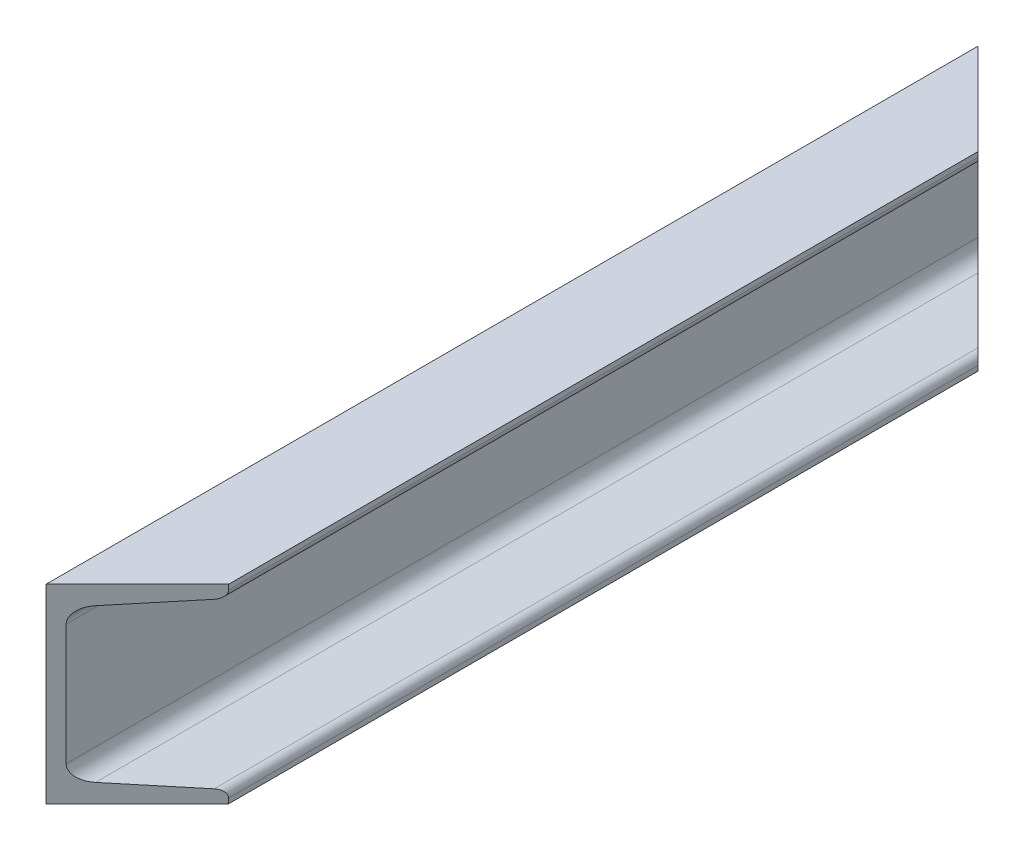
ISO-10303-21;
HEADER;
FILE_DESCRIPTION(('STEP AP214'),'2;1');
FILE_NAME('part.step','',(''),(''),'','','');
FILE_SCHEMA(('AUTOMOTIVE_DESIGN { 1 0 10303 214 1 1 1 1 }'));
ENDSEC;
DATA;
#1=APPLICATION_CONTEXT('core data for automotive mechanical design processes');
#2=APPLICATION_PROTOCOL_DEFINITION('international standard','automotive_design',2000,#1);
#3=PRODUCT_CONTEXT('',#1,'mechanical');
#4=PRODUCT('Part','Part','',(#3));
#5=PRODUCT_RELATED_PRODUCT_CATEGORY('part','',(#4));
#6=PRODUCT_DEFINITION_FORMATION('','',#4);
#7=PRODUCT_DEFINITION_CONTEXT('part definition',#1,'design');
#8=PRODUCT_DEFINITION('design','',#6,#7);
#9=PRODUCT_DEFINITION_SHAPE('','',#8);
#10=(LENGTH_UNIT() NAMED_UNIT(*) SI_UNIT(.MILLI.,.METRE.));
#11=(NAMED_UNIT(*) PLANE_ANGLE_UNIT() SI_UNIT($,.RADIAN.));
#12=(NAMED_UNIT(*) SI_UNIT($,.STERADIAN.) SOLID_ANGLE_UNIT());
#13=UNCERTAINTY_MEASURE_WITH_UNIT(LENGTH_MEASURE(1.E-05),#10,'distance_accuracy_value','');
#14=(GEOMETRIC_REPRESENTATION_CONTEXT(3) GLOBAL_UNCERTAINTY_ASSIGNED_CONTEXT((#13)) GLOBAL_UNIT_ASSIGNED_CONTEXT((#10,
#11,#12)) REPRESENTATION_CONTEXT('',''));
#15=CARTESIAN_POINT('',(0.,0.,0.));
#16=DIRECTION('',(0.,0.,1.));
#17=DIRECTION('',(1.,0.,0.));
#18=AXIS2_PLACEMENT_3D('',#15,#16,#17);
#19=CARTESIAN_POINT('',(48.,47.3249453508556,490.));
#20=DIRECTION('',(-1.,0.,0.));
#21=DIRECTION('',(0.,0.,1.));
#22=AXIS2_PLACEMENT_3D('',#19,#20,#21);
#23=PLANE('',#22);
#24=DIRECTION('',(0.,0.,-1.));
#25=VECTOR('',#24,1.);
#26=CARTESIAN_POINT('',(48.,47.3249453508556,490.));
#27=LINE('',#26,#25);
#28=CARTESIAN_POINT('',(48.,47.3249453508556,441.999999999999));
#29=VERTEX_POINT('',#28);
#30=CARTESIAN_POINT('',(48.,47.3249453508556,48.0000000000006));
#31=VERTEX_POINT('',#30);
#32=EDGE_CURVE('E172',#29,#31,#27,.T.);
#33=ORIENTED_EDGE('',*,*,#32,.T.);
#34=DIRECTION('',(0.,1.,0.));
#35=VECTOR('',#34,1.);
#36=CARTESIAN_POINT('',(48.0000000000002,-440.,48.0000000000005));
#37=LINE('',#36,#35);
#38=CARTESIAN_POINT('',(48.0000000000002,50.,48.0000000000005));
#39=VERTEX_POINT('',#38);
#40=EDGE_CURVE('E142',#31,#39,#37,.T.);
#41=ORIENTED_EDGE('',*,*,#40,.T.);
#42=DIRECTION('',(0.,0.,-1.));
#43=VECTOR('',#42,1.);
#44=CARTESIAN_POINT('',(48.,50.,490.));
#45=LINE('',#44,#43);
#46=CARTESIAN_POINT('',(48.,50.,441.999999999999));
#47=VERTEX_POINT('',#46);
#48=EDGE_CURVE('E11',#47,#39,#45,.T.);
#49=ORIENTED_EDGE('',*,*,#48,.F.);
#50=DIRECTION('',(0.,1.,0.));
#51=VECTOR('',#50,1.);
#52=CARTESIAN_POINT('',(48.,-440.,441.999999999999));
#53=LINE('',#52,#51);
#54=EDGE_CURVE('E200',#29,#47,#53,.T.);
#55=ORIENTED_EDGE('',*,*,#54,.F.);
#56=EDGE_LOOP('',(#33,#41,#49,#55));
#57=FACE_BOUND('',#56,.T.);
#58=ADVANCED_FACE('F41',(#57),#23,.F.);
#59=CARTESIAN_POINT('',(48.,50.,490.));
#60=DIRECTION('',(0.,-1.,0.));
#61=DIRECTION('',(1.,0.,0.));
#62=AXIS2_PLACEMENT_3D('',#59,#60,#61);
#63=PLANE('',#62);
#64=ORIENTED_EDGE('',*,*,#48,.T.);
#65=DIRECTION('',(0.707106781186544,0.,0.707106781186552));
#66=VECTOR('',#65,1.);
#67=CARTESIAN_POINT('',(48.0000000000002,50.,48.0000000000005));
#68=LINE('',#67,#66);
#69=CARTESIAN_POINT('',(0.,50.,0.));
#70=VERTEX_POINT('',#69);
#71=EDGE_CURVE('E129',#70,#39,#68,.T.);
#72=ORIENTED_EDGE('',*,*,#71,.F.);
#73=DIRECTION('',(0.,0.,-1.));
#74=VECTOR('',#73,1.);
#75=CARTESIAN_POINT('',(0.,50.,490.));
#76=LINE('',#75,#74);
#77=CARTESIAN_POINT('',(0.,50.,490.));
#78=VERTEX_POINT('',#77);
#79=EDGE_CURVE('E48',#78,#70,#76,.T.);
#80=ORIENTED_EDGE('',*,*,#79,.F.);
#81=DIRECTION('',(-0.707106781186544,0.,0.707106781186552));
#82=VECTOR('',#81,1.);
#83=CARTESIAN_POINT('',(48.,50.,441.999999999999));
#84=LINE('',#83,#82);
#85=EDGE_CURVE('E55',#47,#78,#84,.T.);
#86=ORIENTED_EDGE('',*,*,#85,.F.);
#87=EDGE_LOOP('',(#64,#72,#80,#86));
#88=FACE_BOUND('',#87,.T.);
#89=ADVANCED_FACE('F139',(#88),#63,.F.);
#90=CARTESIAN_POINT('',(0.,50.,490.));
#91=DIRECTION('',(1.,0.,0.));
#92=DIRECTION('',(0.,1.,0.));
#93=AXIS2_PLACEMENT_3D('',#90,#91,#92);
#94=PLANE('',#93);
#95=DIRECTION('',(0.,-1.,0.));
#96=VECTOR('',#95,1.);
#97=CARTESIAN_POINT('',(0.,50.,0.));
#98=LINE('',#97,#96);
#99=CARTESIAN_POINT('',(0.,-50.,0.));
#100=VERTEX_POINT('',#99);
#101=EDGE_CURVE('E126',#70,#100,#98,.T.);
#102=ORIENTED_EDGE('',*,*,#101,.T.);
#103=DIRECTION('',(0.,0.,-1.));
#104=VECTOR('',#103,1.);
#105=CARTESIAN_POINT('',(0.,-50.,490.));
#106=LINE('',#105,#104);
#107=CARTESIAN_POINT('',(0.,-50.,490.));
#108=VERTEX_POINT('',#107);
#109=EDGE_CURVE('E145',#108,#100,#106,.T.);
#110=ORIENTED_EDGE('',*,*,#109,.F.);
#111=DIRECTION('',(0.,-1.,0.));
#112=VECTOR('',#111,1.);
#113=CARTESIAN_POINT('',(0.,50.,490.));
#114=LINE('',#113,#112);
#115=EDGE_CURVE('E135',#78,#108,#114,.T.);
#116=ORIENTED_EDGE('',*,*,#115,.F.);
#117=ORIENTED_EDGE('',*,*,#79,.T.);
#118=EDGE_LOOP('',(#102,#110,#116,#117));
#119=FACE_BOUND('',#118,.T.);
#120=ADVANCED_FACE('F144',(#119),#94,.F.);
#121=CARTESIAN_POINT('',(0.,-50.,490.));
#122=DIRECTION('',(0.,1.,0.));
#123=DIRECTION('',(0.,0.,1.));
#124=AXIS2_PLACEMENT_3D('',#121,#122,#123);
#125=PLANE('',#124);
#126=ORIENTED_EDGE('',*,*,#109,.T.);
#127=DIRECTION('',(0.707106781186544,0.,0.707106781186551));
#128=VECTOR('',#127,1.);
#129=CARTESIAN_POINT('',(245.,-50.,245.000000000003));
#130=LINE('',#129,#128);
#131=CARTESIAN_POINT('',(48.,-50.,48.0000000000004));
#132=VERTEX_POINT('',#131);
#133=EDGE_CURVE('E63',#100,#132,#130,.T.);
#134=ORIENTED_EDGE('',*,*,#133,.T.);
#135=DIRECTION('',(0.,0.,-1.));
#136=VECTOR('',#135,1.);
#137=CARTESIAN_POINT('',(48.,-50.,490.));
#138=LINE('',#137,#136);
#139=CARTESIAN_POINT('',(48.,-50.,441.999999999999));
#140=VERTEX_POINT('',#139);
#141=EDGE_CURVE('E146',#140,#132,#138,.T.);
#142=ORIENTED_EDGE('',*,*,#141,.F.);
#143=DIRECTION('',(-0.707106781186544,0.,0.707106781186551));
#144=VECTOR('',#143,1.);
#145=CARTESIAN_POINT('',(0.,-50.,490.));
#146=LINE('',#145,#144);
#147=EDGE_CURVE('E136',#140,#108,#146,.T.);
#148=ORIENTED_EDGE('',*,*,#147,.T.);
#149=EDGE_LOOP('',(#126,#134,#142,#148));
#150=FACE_BOUND('',#149,.T.);
#151=ADVANCED_FACE('F263',(#150),#125,.F.);
#152=CARTESIAN_POINT('',(48.,-50.,490.));
#153=DIRECTION('',(-1.,0.,0.));
#154=DIRECTION('',(0.,0.,1.));
#155=AXIS2_PLACEMENT_3D('',#152,#153,#154);
#156=PLANE('',#155);
#157=ORIENTED_EDGE('',*,*,#141,.T.);
#158=CARTESIAN_POINT('',(48.,-47.3249453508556,48.0000000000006));
#159=VERTEX_POINT('',#158);
#160=EDGE_CURVE('E225',#132,#159,#37,.T.);
#161=ORIENTED_EDGE('',*,*,#160,.T.);
#162=DIRECTION('',(0.,0.,-1.));
#163=VECTOR('',#162,1.);
#164=CARTESIAN_POINT('',(48.,-47.3249453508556,490.));
#165=LINE('',#164,#163);
#166=CARTESIAN_POINT('',(48.,-47.3249453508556,441.999999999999));
#167=VERTEX_POINT('',#166);
#168=EDGE_CURVE('E151',#167,#159,#165,.T.);
#169=ORIENTED_EDGE('',*,*,#168,.F.);
#170=EDGE_CURVE('E199',#140,#167,#53,.T.);
#171=ORIENTED_EDGE('',*,*,#170,.F.);
#172=EDGE_LOOP('',(#157,#161,#169,#171));
#173=FACE_BOUND('',#172,.T.);
#174=ADVANCED_FACE('F230',(#173),#156,.F.);
#175=CARTESIAN_POINT('',(43.8000000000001,-47.3249453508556,490.));
#176=DIRECTION('',(0.,0.,-1.));
#177=DIRECTION('',(-1.,0.,0.));
#178=AXIS2_PLACEMENT_3D('',#175,#176,#177);
#179=CYLINDRICAL_SURFACE('',#178,4.2);
#180=ORIENTED_EDGE('',*,*,#168,.T.);
#181=CARTESIAN_POINT('',(43.8000000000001,-47.3249453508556,43.8000000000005));
#182=DIRECTION('',(-0.707106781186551,0.,0.707106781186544));
#183=DIRECTION('',(-0.707106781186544,0.,-0.707106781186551));
#184=AXIS2_PLACEMENT_3D('',#181,#182,#183);
#185=ELLIPSE('',#184,5.93969696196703,4.2);
#186=CARTESIAN_POINT('',(44.1917276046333,-43.1432531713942,44.1917276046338));
#187=VERTEX_POINT('',#186);
#188=EDGE_CURVE('E204',#159,#187,#185,.T.);
#189=ORIENTED_EDGE('',*,*,#188,.T.);
#190=DIRECTION('',(0.,0.,-1.));
#191=VECTOR('',#190,1.);
#192=CARTESIAN_POINT('',(44.1917276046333,-43.1432531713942,490.));
#193=LINE('',#192,#191);
#194=CARTESIAN_POINT('',(44.1917276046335,-43.1432531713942,445.808272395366));
#195=VERTEX_POINT('',#194);
#196=EDGE_CURVE('E154',#195,#187,#193,.T.);
#197=ORIENTED_EDGE('',*,*,#196,.F.);
#198=CARTESIAN_POINT('',(43.8000000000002,-47.3249453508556,446.199999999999));
#199=DIRECTION('',(-0.707106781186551,0.,-0.707106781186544));
#200=DIRECTION('',(0.707106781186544,0.,-0.707106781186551));
#201=AXIS2_PLACEMENT_3D('',#198,#199,#200);
#202=ELLIPSE('',#201,5.93969696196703,4.2);
#203=EDGE_CURVE('E178',#195,#167,#202,.T.);
#204=ORIENTED_EDGE('',*,*,#203,.T.);
#205=EDGE_LOOP('',(#180,#189,#197,#204));
#206=FACE_BOUND('',#205,.T.);
#207=ADVANCED_FACE('F234',(#206),#179,.T.);
#208=CARTESIAN_POINT('',(44.1917276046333,-43.1432531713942,490.));
#209=DIRECTION('',(-0.0932684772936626,-0.995640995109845,0.));
#210=DIRECTION('',(0.995640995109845,-0.0932684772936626,0.));
#211=AXIS2_PLACEMENT_3D('',#208,#209,#210);
#212=PLANE('',#211);
#213=ORIENTED_EDGE('',*,*,#196,.T.);
#214=DIRECTION('',(-0.70556059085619,0.0660946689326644,-0.705560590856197));
#215=VECTOR('',#214,1.);
#216=CARTESIAN_POINT('',(266.122105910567,-63.9329841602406,266.12210591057));
#217=LINE('',#216,#215);
#218=CARTESIAN_POINT('',(13.007217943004,-40.2219876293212,13.007217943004));
#219=VERTEX_POINT('',#218);
#220=EDGE_CURVE('E207',#187,#219,#217,.T.);
#221=ORIENTED_EDGE('',*,*,#220,.T.);
#222=DIRECTION('',(0.,0.,-1.));
#223=VECTOR('',#222,1.);
#224=CARTESIAN_POINT('',(13.0072179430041,-40.2219876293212,490.));
#225=LINE('',#224,#223);
#226=CARTESIAN_POINT('',(13.0072179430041,-40.2219876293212,476.992782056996));
#227=VERTEX_POINT('',#226);
#228=EDGE_CURVE('E157',#227,#219,#225,.T.);
#229=ORIENTED_EDGE('',*,*,#228,.F.);
#230=DIRECTION('',(0.70556059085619,-0.0660946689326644,-0.705560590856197));
#231=VECTOR('',#230,1.);
#232=CARTESIAN_POINT('',(22.1923896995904,-41.0824252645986,467.80761030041));
#233=LINE('',#232,#231);
#234=EDGE_CURVE('E181',#227,#195,#233,.T.);
#235=ORIENTED_EDGE('',*,*,#234,.T.);
#236=EDGE_LOOP('',(#213,#221,#229,#235));
#237=FACE_BOUND('',#236,.T.);
#238=ADVANCED_FACE('F239',(#237),#212,.F.);
#239=CARTESIAN_POINT('',(13.8,-31.7590391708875,490.));
#240=DIRECTION('',(0.,0.,-1.));
#241=DIRECTION('',(-1.,0.,0.));
#242=AXIS2_PLACEMENT_3D('',#239,#240,#241);
#243=CYLINDRICAL_SURFACE('',#242,8.5);
#244=ORIENTED_EDGE('',*,*,#228,.T.);
#245=CARTESIAN_POINT('',(13.8,-31.7590391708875,13.8000000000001));
#246=DIRECTION('',(-0.707106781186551,0.,0.707106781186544));
#247=DIRECTION('',(-0.707106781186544,0.,-0.707106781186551));
#248=AXIS2_PLACEMENT_3D('',#245,#246,#247);
#249=ELLIPSE('',#248,12.0208152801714,8.5);
#250=CARTESIAN_POINT('',(5.30000000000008,-31.7590391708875,5.29999999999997));
#251=VERTEX_POINT('',#250);
#252=EDGE_CURVE('E210',#219,#251,#249,.F.);
#253=ORIENTED_EDGE('',*,*,#252,.T.);
#254=DIRECTION('',(0.,0.,-1.));
#255=VECTOR('',#254,1.);
#256=CARTESIAN_POINT('',(5.30000000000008,-31.7590391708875,490.));
#257=LINE('',#256,#255);
#258=CARTESIAN_POINT('',(5.30000000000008,-31.7590391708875,484.7));
#259=VERTEX_POINT('',#258);
#260=EDGE_CURVE('E160',#259,#251,#257,.T.);
#261=ORIENTED_EDGE('',*,*,#260,.F.);
#262=CARTESIAN_POINT('',(13.8000000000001,-31.7590391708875,476.2));
#263=DIRECTION('',(-0.707106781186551,0.,-0.707106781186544));
#264=DIRECTION('',(0.707106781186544,0.,-0.707106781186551));
#265=AXIS2_PLACEMENT_3D('',#262,#263,#264);
#266=ELLIPSE('',#265,12.0208152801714,8.5);
#267=EDGE_CURVE('E184',#259,#227,#266,.F.);
#268=ORIENTED_EDGE('',*,*,#267,.T.);
#269=EDGE_LOOP('',(#244,#253,#261,#268));
#270=FACE_BOUND('',#269,.T.);
#271=ADVANCED_FACE('F241',(#270),#243,.F.);
#272=CARTESIAN_POINT('',(5.30000000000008,-31.7590391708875,490.));
#273=DIRECTION('',(-1.,0.,0.));
#274=DIRECTION('',(0.,-1.,0.));
#275=AXIS2_PLACEMENT_3D('',#272,#273,#274);
#276=PLANE('',#275);
#277=ORIENTED_EDGE('',*,*,#260,.T.);
#278=DIRECTION('',(0.,1.,0.));
#279=VECTOR('',#278,1.);
#280=CARTESIAN_POINT('',(5.30000000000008,-31.7590391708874,5.29999999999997));
#281=LINE('',#280,#279);
#282=CARTESIAN_POINT('',(5.30000000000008,31.7590391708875,5.30000000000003));
#283=VERTEX_POINT('',#282);
#284=EDGE_CURVE('E213',#251,#283,#281,.T.);
#285=ORIENTED_EDGE('',*,*,#284,.T.);
#286=DIRECTION('',(0.,0.,-1.));
#287=VECTOR('',#286,1.);
#288=CARTESIAN_POINT('',(5.30000000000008,31.7590391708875,490.));
#289=LINE('',#288,#287);
#290=CARTESIAN_POINT('',(5.30000000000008,31.7590391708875,484.7));
#291=VERTEX_POINT('',#290);
#292=EDGE_CURVE('E163',#291,#283,#289,.T.);
#293=ORIENTED_EDGE('',*,*,#292,.F.);
#294=DIRECTION('',(0.,-1.,0.));
#295=VECTOR('',#294,1.);
#296=CARTESIAN_POINT('',(5.30000000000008,-31.7590391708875,484.7));
#297=LINE('',#296,#295);
#298=EDGE_CURVE('E187',#291,#259,#297,.T.);
#299=ORIENTED_EDGE('',*,*,#298,.T.);
#300=EDGE_LOOP('',(#277,#285,#293,#299));
#301=FACE_BOUND('',#300,.T.);
#302=ADVANCED_FACE('F245',(#301),#276,.F.);
#303=CARTESIAN_POINT('',(13.8,31.7590391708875,490.));
#304=DIRECTION('',(0.,0.,-1.));
#305=DIRECTION('',(-1.,0.,0.));
#306=AXIS2_PLACEMENT_3D('',#303,#304,#305);
#307=CYLINDRICAL_SURFACE('',#306,8.5);
#308=ORIENTED_EDGE('',*,*,#292,.T.);
#309=CARTESIAN_POINT('',(13.8000000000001,31.7590391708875,13.8000000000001));
#310=DIRECTION('',(-0.707106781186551,0.,0.707106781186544));
#311=DIRECTION('',(-0.707106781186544,0.,-0.707106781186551));
#312=AXIS2_PLACEMENT_3D('',#309,#310,#311);
#313=ELLIPSE('',#312,12.0208152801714,8.5);
#314=CARTESIAN_POINT('',(13.0072179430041,40.2219876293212,13.0072179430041));
#315=VERTEX_POINT('',#314);
#316=EDGE_CURVE('E216',#283,#315,#313,.F.);
#317=ORIENTED_EDGE('',*,*,#316,.T.);
#318=DIRECTION('',(0.,0.,-1.));
#319=VECTOR('',#318,1.);
#320=CARTESIAN_POINT('',(13.0072179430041,40.2219876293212,490.));
#321=LINE('',#320,#319);
#322=CARTESIAN_POINT('',(13.0072179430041,40.2219876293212,476.992782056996));
#323=VERTEX_POINT('',#322);
#324=EDGE_CURVE('E166',#323,#315,#321,.T.);
#325=ORIENTED_EDGE('',*,*,#324,.F.);
#326=CARTESIAN_POINT('',(13.8000000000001,31.7590391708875,476.2));
#327=DIRECTION('',(-0.707106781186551,0.,-0.707106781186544));
#328=DIRECTION('',(0.707106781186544,0.,-0.707106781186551));
#329=AXIS2_PLACEMENT_3D('',#326,#327,#328);
#330=ELLIPSE('',#329,12.0208152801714,8.5);
#331=EDGE_CURVE('E190',#323,#291,#330,.F.);
#332=ORIENTED_EDGE('',*,*,#331,.T.);
#333=EDGE_LOOP('',(#308,#317,#325,#332));
#334=FACE_BOUND('',#333,.T.);
#335=ADVANCED_FACE('F247',(#334),#307,.F.);
#336=CARTESIAN_POINT('',(13.0072179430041,40.2219876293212,490.));
#337=DIRECTION('',(-0.0932684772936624,0.995640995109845,0.));
#338=DIRECTION('',(-0.995640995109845,-0.0932684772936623,0.));
#339=AXIS2_PLACEMENT_3D('',#336,#337,#338);
#340=PLANE('',#339);
#341=ORIENTED_EDGE('',*,*,#324,.T.);
#342=DIRECTION('',(0.70556059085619,0.0660946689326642,0.705560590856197));
#343=VECTOR('',#342,1.);
#344=CARTESIAN_POINT('',(250.461736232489,62.4659706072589,250.461736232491));
#345=LINE('',#344,#343);
#346=CARTESIAN_POINT('',(44.1917276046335,43.1432531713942,44.1917276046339));
#347=VERTEX_POINT('',#346);
#348=EDGE_CURVE('E219',#315,#347,#345,.T.);
#349=ORIENTED_EDGE('',*,*,#348,.T.);
#350=DIRECTION('',(0.,0.,-1.));
#351=VECTOR('',#350,1.);
#352=CARTESIAN_POINT('',(44.1917276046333,43.1432531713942,490.));
#353=LINE('',#352,#351);
#354=CARTESIAN_POINT('',(44.1917276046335,43.1432531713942,445.808272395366));
#355=VERTEX_POINT('',#354);
#356=EDGE_CURVE('E169',#355,#347,#353,.T.);
#357=ORIENTED_EDGE('',*,*,#356,.F.);
#358=DIRECTION('',(-0.70556059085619,-0.0660946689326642,0.705560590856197));
#359=VECTOR('',#358,1.);
#360=CARTESIAN_POINT('',(6.53202002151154,39.615411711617,483.467979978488));
#361=LINE('',#360,#359);
#362=EDGE_CURVE('E193',#355,#323,#361,.T.);
#363=ORIENTED_EDGE('',*,*,#362,.T.);
#364=EDGE_LOOP('',(#341,#349,#357,#363));
#365=FACE_BOUND('',#364,.T.);
#366=ADVANCED_FACE('F251',(#365),#340,.F.);
#367=CARTESIAN_POINT('',(43.8000000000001,47.3249453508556,490.));
#368=DIRECTION('',(0.,0.,-1.));
#369=DIRECTION('',(-1.,0.,0.));
#370=AXIS2_PLACEMENT_3D('',#367,#368,#369);
#371=CYLINDRICAL_SURFACE('',#370,4.2);
#372=ORIENTED_EDGE('',*,*,#356,.T.);
#373=CARTESIAN_POINT('',(43.8000000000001,47.3249453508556,43.8000000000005));
#374=DIRECTION('',(-0.707106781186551,0.,0.707106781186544));
#375=DIRECTION('',(-0.707106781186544,0.,-0.707106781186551));
#376=AXIS2_PLACEMENT_3D('',#373,#374,#375);
#377=ELLIPSE('',#376,5.93969696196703,4.2);
#378=EDGE_CURVE('E222',#347,#31,#377,.T.);
#379=ORIENTED_EDGE('',*,*,#378,.T.);
#380=ORIENTED_EDGE('',*,*,#32,.F.);
#381=CARTESIAN_POINT('',(43.8000000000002,47.3249453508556,446.199999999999));
#382=DIRECTION('',(-0.707106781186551,0.,-0.707106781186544));
#383=DIRECTION('',(0.707106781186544,0.,-0.707106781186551));
#384=AXIS2_PLACEMENT_3D('',#381,#382,#383);
#385=ELLIPSE('',#384,5.93969696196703,4.2);
#386=EDGE_CURVE('E196',#29,#355,#385,.T.);
#387=ORIENTED_EDGE('',*,*,#386,.T.);
#388=EDGE_LOOP('',(#372,#379,#380,#387));
#389=FACE_BOUND('',#388,.T.);
#390=ADVANCED_FACE('F253',(#389),#371,.T.);
#391=CARTESIAN_POINT('',(48.,-440.,441.999999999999));
#392=DIRECTION('',(-0.707106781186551,0.,-0.707106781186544));
#393=DIRECTION('',(-0.707106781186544,0.,0.707106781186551));
#394=AXIS2_PLACEMENT_3D('',#391,#392,#393);
#395=PLANE('',#394);
#396=ORIENTED_EDGE('',*,*,#170,.T.);
#397=ORIENTED_EDGE('',*,*,#203,.F.);
#398=ORIENTED_EDGE('',*,*,#234,.F.);
#399=ORIENTED_EDGE('',*,*,#267,.F.);
#400=ORIENTED_EDGE('',*,*,#298,.F.);
#401=ORIENTED_EDGE('',*,*,#331,.F.);
#402=ORIENTED_EDGE('',*,*,#362,.F.);
#403=ORIENTED_EDGE('',*,*,#386,.F.);
#404=ORIENTED_EDGE('',*,*,#54,.T.);
#405=ORIENTED_EDGE('',*,*,#85,.T.);
#406=ORIENTED_EDGE('',*,*,#115,.T.);
#407=ORIENTED_EDGE('',*,*,#147,.F.);
#408=EDGE_LOOP('',(#396,#397,#398,#399,#400,#401,#402,#403,#404,#405,#406,#407));
#409=FACE_BOUND('',#408,.T.);
#410=ADVANCED_FACE('F236',(#409),#395,.F.);
#411=CARTESIAN_POINT('',(48.0000000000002,-440.,48.0000000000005));
#412=DIRECTION('',(-0.707106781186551,0.,0.707106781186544));
#413=DIRECTION('',(0.707106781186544,0.,0.707106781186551));
#414=AXIS2_PLACEMENT_3D('',#411,#412,#413);
#415=PLANE('',#414);
#416=ORIENTED_EDGE('',*,*,#101,.F.);
#417=ORIENTED_EDGE('',*,*,#71,.T.);
#418=ORIENTED_EDGE('',*,*,#40,.F.);
#419=ORIENTED_EDGE('',*,*,#378,.F.);
#420=ORIENTED_EDGE('',*,*,#348,.F.);
#421=ORIENTED_EDGE('',*,*,#316,.F.);
#422=ORIENTED_EDGE('',*,*,#284,.F.);
#423=ORIENTED_EDGE('',*,*,#252,.F.);
#424=ORIENTED_EDGE('',*,*,#220,.F.);
#425=ORIENTED_EDGE('',*,*,#188,.F.);
#426=ORIENTED_EDGE('',*,*,#160,.F.);
#427=ORIENTED_EDGE('',*,*,#133,.F.);
#428=EDGE_LOOP('',(#416,#417,#418,#419,#420,#421,#422,#423,#424,#425,#426,#427));
#429=FACE_BOUND('',#428,.T.);
#430=ADVANCED_FACE('F128',(#429),#415,.F.);
#431=CLOSED_SHELL('',(#58,#89,#120,#151,#174,#207,#238,#271,#302,#335,#366,#390,#410,#430));
#432=MANIFOLD_SOLID_BREP('B2',#431);
#433=ADVANCED_BREP_SHAPE_REPRESENTATION('',(#18,#432),#14);
#434=SHAPE_DEFINITION_REPRESENTATION(#9,#433);
ENDSEC;
END-ISO-10303-21;
